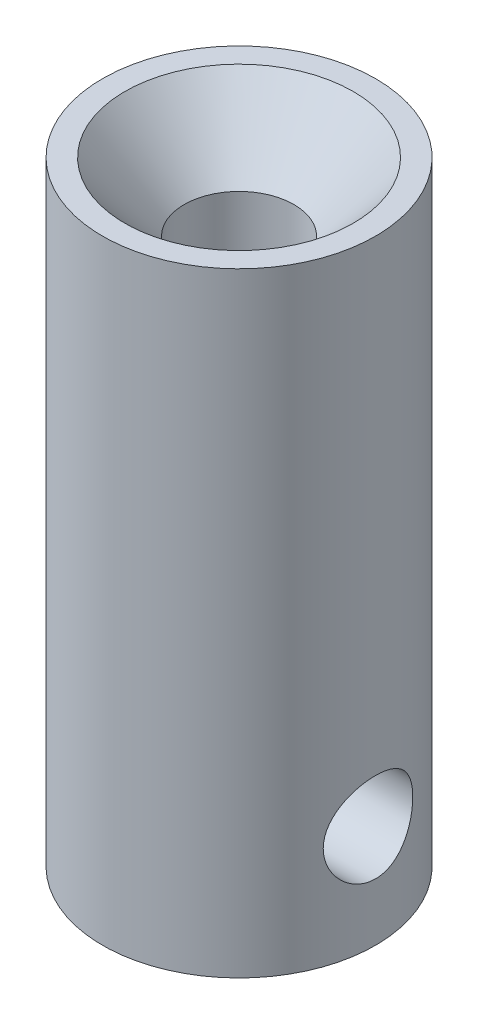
from build123d import *

# Parameters (mm, degrees)
SKETCH2_R          = 2.0828
CUT_EXTRUDE1_DEPTH = 24.970724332


with BuildPart() as part:
    # Sketch1 → Base-Revolve (revolve)
    with BuildSketch(Plane.XY, mode=Mode.PRIVATE) as base_revolve_sk:
        Polygon((2.5527, 0), (2.5527, 19.05), (5.312685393, 22.225), (6.35, 22.225), (6.35, 0), (6.35, -6.35), (2.5527, -6.35), align=None)
    revolve(base_revolve_sk.sketch.rotate(Axis((0, 0, 0), (0, 1, 0)), 90), axis=Axis((0, 0, 0), (0, 1, 0)))

    # Sketch2 → Cut-Extrude1 (cut, through all)
    with BuildSketch(Plane(origin=(0, 0, 0), x_dir=(0, 0, -1), z_dir=(1, 0, 0))):
        with Locations(Location((0, -1.5875, 0), (0, 0, 180))):
            Circle(SKETCH2_R)
    extrude(amount=CUT_EXTRUDE1_DEPTH, mode=Mode.SUBTRACT)


solid = part.part
